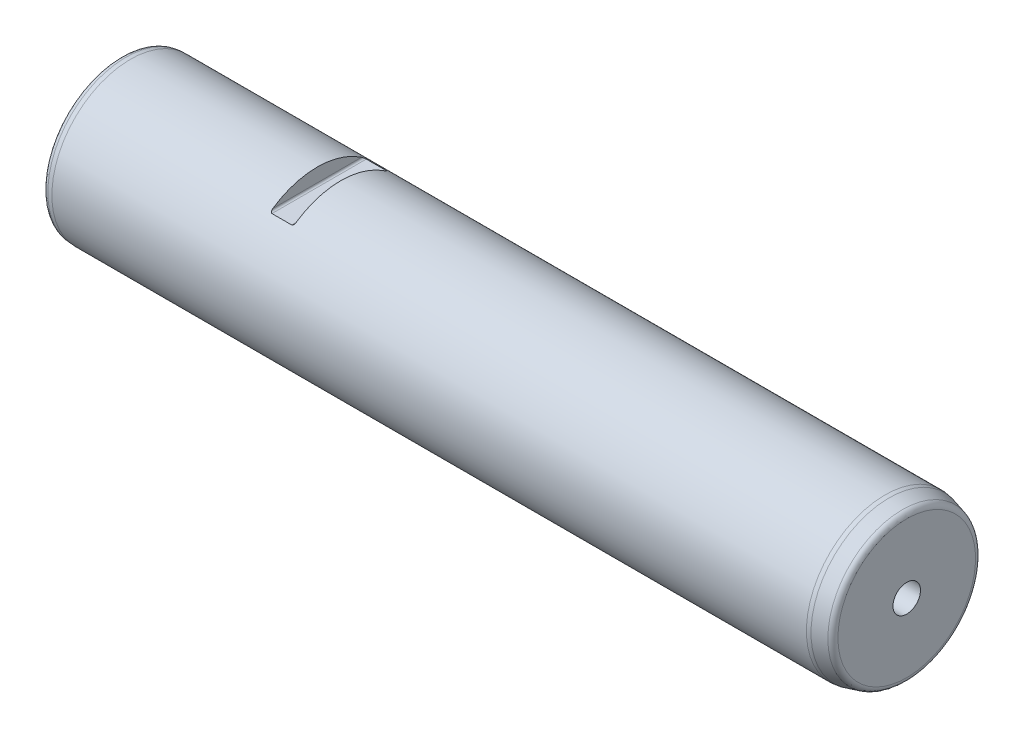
ISO-10303-21;
HEADER;
FILE_DESCRIPTION(('STEP AP214'),'2;1');
FILE_NAME('part.step','',(''),(''),'','','');
FILE_SCHEMA(('AUTOMOTIVE_DESIGN { 1 0 10303 214 1 1 1 1 }'));
ENDSEC;
DATA;
#1=APPLICATION_CONTEXT('core data for automotive mechanical design processes');
#2=APPLICATION_PROTOCOL_DEFINITION('international standard','automotive_design',2000,#1);
#3=PRODUCT_CONTEXT('',#1,'mechanical');
#4=PRODUCT('Part','Part','',(#3));
#5=PRODUCT_RELATED_PRODUCT_CATEGORY('part','',(#4));
#6=PRODUCT_DEFINITION_FORMATION('','',#4);
#7=PRODUCT_DEFINITION_CONTEXT('part definition',#1,'design');
#8=PRODUCT_DEFINITION('design','',#6,#7);
#9=PRODUCT_DEFINITION_SHAPE('','',#8);
#10=(LENGTH_UNIT() NAMED_UNIT(*) SI_UNIT(.MILLI.,.METRE.));
#11=(NAMED_UNIT(*) PLANE_ANGLE_UNIT() SI_UNIT($,.RADIAN.));
#12=(NAMED_UNIT(*) SI_UNIT($,.STERADIAN.) SOLID_ANGLE_UNIT());
#13=UNCERTAINTY_MEASURE_WITH_UNIT(LENGTH_MEASURE(1.E-05),#10,'distance_accuracy_value','');
#14=(GEOMETRIC_REPRESENTATION_CONTEXT(3) GLOBAL_UNCERTAINTY_ASSIGNED_CONTEXT((#13)) GLOBAL_UNIT_ASSIGNED_CONTEXT((#10,
#11,#12)) REPRESENTATION_CONTEXT('',''));
#15=CARTESIAN_POINT('',(0.,0.,0.));
#16=DIRECTION('',(0.,0.,1.));
#17=DIRECTION('',(1.,0.,0.));
#18=AXIS2_PLACEMENT_3D('',#15,#16,#17);
#19=CARTESIAN_POINT('',(0.,0.,0.));
#20=DIRECTION('',(1.,0.,0.));
#21=DIRECTION('',(0.,0.,-1.));
#22=AXIS2_PLACEMENT_3D('',#19,#20,#21);
#23=PLANE('',#22);
#24=CARTESIAN_POINT('',(0.,0.,0.));
#25=DIRECTION('',(1.,0.,0.));
#26=DIRECTION('',(0.,0.,-1.));
#27=AXIS2_PLACEMENT_3D('',#24,#25,#26);
#28=CIRCLE('',#27,36.8135631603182);
#29=CARTESIAN_POINT('',(0.,0.,-36.8135631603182));
#30=VERTEX_POINT('',#29);
#31=EDGE_CURVE('E158',#30,#30,#28,.F.);
#32=ORIENTED_EDGE('',*,*,#31,.T.);
#33=EDGE_LOOP('',(#32));
#34=FACE_BOUND('',#33,.T.);
#35=ADVANCED_FACE('F15',(#34),#23,.F.);
#36=CARTESIAN_POINT('',(0.,0.,0.));
#37=DIRECTION('',(-1.,0.,0.));
#38=DIRECTION('',(0.,0.,1.));
#39=AXIS2_PLACEMENT_3D('',#36,#37,#38);
#40=CYLINDRICAL_SURFACE('',#39,40.);
#41=CARTESIAN_POINT('',(112.,0.,0.));
#42=DIRECTION('',(1.,0.,0.));
#43=DIRECTION('',(0.,1.,0.));
#44=AXIS2_PLACEMENT_3D('',#41,#42,#43);
#45=CIRCLE('',#44,40.);
#46=CARTESIAN_POINT('',(112.,33.,-22.6053091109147));
#47=VERTEX_POINT('',#46);
#48=CARTESIAN_POINT('',(112.,33.,22.6053091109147));
#49=VERTEX_POINT('',#48);
#50=EDGE_CURVE('E9',#47,#49,#45,.T.);
#51=ORIENTED_EDGE('',*,*,#50,.T.);
#52=CARTESIAN_POINT('',(112.,33.,22.6053091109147));
#53=CARTESIAN_POINT('',(111.999956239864,32.9533062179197,22.6734793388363));
#54=CARTESIAN_POINT('',(111.996724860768,32.9063709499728,22.7415390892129));
#55=CARTESIAN_POINT('',(111.9833741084,32.8121892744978,22.8772162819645));
#56=CARTESIAN_POINT('',(111.973223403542,32.764942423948,22.9448302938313));
#57=CARTESIAN_POINT('',(111.945383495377,32.6703030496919,23.0793877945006));
#58=CARTESIAN_POINT('',(111.927624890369,32.6229132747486,23.1463191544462));
#59=CARTESIAN_POINT('',(111.883718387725,32.5291271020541,23.277937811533));
#60=CARTESIAN_POINT('',(111.857588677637,32.4827287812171,23.3426296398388));
#61=CARTESIAN_POINT('',(111.802378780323,32.4016320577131,23.4550198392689));
#62=CARTESIAN_POINT('',(111.77516014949,32.3665742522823,23.5033665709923));
#63=CARTESIAN_POINT('',(111.713954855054,32.2983090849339,23.5970884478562));
#64=CARTESIAN_POINT('',(111.679967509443,32.2651019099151,23.6424632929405));
#65=CARTESIAN_POINT('',(111.603736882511,32.201241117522,23.7293702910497));
#66=CARTESIAN_POINT('',(111.561384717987,32.1706297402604,23.7708397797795));
#67=CARTESIAN_POINT('',(111.467801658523,32.1145012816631,23.8466142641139));
#68=CARTESIAN_POINT('',(111.416609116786,32.0889631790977,23.8809488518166));
#69=CARTESIAN_POINT('',(111.329466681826,32.0552261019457,23.9261971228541));
#70=CARTESIAN_POINT('',(111.29649313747,32.0443038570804,23.9408193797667));
#71=CARTESIAN_POINT('',(111.228097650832,32.0257208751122,23.9656721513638));
#72=CARTESIAN_POINT('',(111.192682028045,32.0180520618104,23.9759135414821));
#73=CARTESIAN_POINT('',(111.130975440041,32.0082798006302,23.9889572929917));
#74=CARTESIAN_POINT('',(111.10511035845,32.0051988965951,23.9930670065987));
#75=CARTESIAN_POINT('',(111.05284071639,32.0010479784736,23.998602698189));
#76=CARTESIAN_POINT('',(111.026434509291,31.9999854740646,24.0000186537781));
#77=CARTESIAN_POINT('',(111.,32.,24.));
#78=B_SPLINE_CURVE_WITH_KNOTS('',3,(#52,#53,#54,#55,#56,#57,#58,#59,#60,#61,#62,#63,#64,#65,#66,
#67,#68,#69,#70,#71,#72,#73,#74,#75,#76,#77),.UNSPECIFIED.,.F.,.F.,(4,2,2,2,2,2,2,2,2,2,2,2,4),
(0.,0.247894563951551,0.496919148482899,0.748265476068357,0.999069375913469,1.19560905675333,
1.39216855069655,1.59147884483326,1.78994522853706,1.90262338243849,2.01502016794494,
2.09392287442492,2.17311857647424),.UNSPECIFIED.);
#79=CARTESIAN_POINT('',(111.,32.,24.));
#80=VERTEX_POINT('',#79);
#81=EDGE_CURVE('E23',#49,#80,#78,.T.);
#82=ORIENTED_EDGE('',*,*,#81,.T.);
#83=DIRECTION('',(-1.,0.,0.));
#84=VECTOR('',#83,1.);
#85=CARTESIAN_POINT('',(0.,32.,24.));
#86=LINE('',#85,#84);
#87=CARTESIAN_POINT('',(101.,32.,24.));
#88=VERTEX_POINT('',#87);
#89=EDGE_CURVE('E72',#80,#88,#86,.T.);
#90=ORIENTED_EDGE('',*,*,#89,.T.);
#91=CARTESIAN_POINT('',(101.,32.,24.));
#92=CARTESIAN_POINT('',(100.979515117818,31.9999961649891,24.0000048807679));
#93=CARTESIAN_POINT('',(100.959045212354,32.0006300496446,23.9991599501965));
#94=CARTESIAN_POINT('',(100.918340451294,32.0031320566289,23.9958234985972));
#95=CARTESIAN_POINT('',(100.898105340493,32.0049986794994,23.9933339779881));
#96=CARTESIAN_POINT('',(100.838485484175,32.0123267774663,23.9835569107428));
#97=CARTESIAN_POINT('',(100.799665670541,32.0195187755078,23.9739578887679));
#98=CARTESIAN_POINT('',(100.724972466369,32.0377946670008,23.949528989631));
#99=CARTESIAN_POINT('',(100.689086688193,32.048861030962,23.9347226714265));
#100=CARTESIAN_POINT('',(100.620448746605,32.0741044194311,23.9008843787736));
#101=CARTESIAN_POINT('',(100.587706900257,32.0882912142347,23.8818391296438));
#102=CARTESIAN_POINT('',(100.50892843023,32.1272536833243,23.8294171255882));
#103=CARTESIAN_POINT('',(100.46516671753,32.1536303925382,23.7938287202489));
#104=CARTESIAN_POINT('',(100.38502670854,32.209926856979,23.7175646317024));
#105=CARTESIAN_POINT('',(100.34866354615,32.2398536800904,23.6768787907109));
#106=CARTESIAN_POINT('',(100.288885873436,32.2959720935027,23.6002540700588));
#107=CARTESIAN_POINT('',(100.264326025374,32.3217752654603,23.5649069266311));
#108=CARTESIAN_POINT('',(100.219071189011,32.3744164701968,23.4925343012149));
#109=CARTESIAN_POINT('',(100.198378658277,32.4012551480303,23.4555077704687));
#110=CARTESIAN_POINT('',(100.141431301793,32.4829971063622,23.3423121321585));
#111=CARTESIAN_POINT('',(100.110455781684,32.5389782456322,23.2642288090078));
#112=CARTESIAN_POINT('',(100.07059809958,32.6291137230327,23.1375093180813));
#113=CARTESIAN_POINT('',(100.057848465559,32.662928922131,23.0897499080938));
#114=CARTESIAN_POINT('',(100.036262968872,32.7307800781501,22.9934663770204));
#115=CARTESIAN_POINT('',(100.027428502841,32.7648161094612,22.9449419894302));
#116=CARTESIAN_POINT('',(100.013537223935,32.832462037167,22.8480389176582));
#117=CARTESIAN_POINT('',(100.008432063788,32.8660716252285,22.7996667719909));
#118=CARTESIAN_POINT('',(100.001670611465,32.9331582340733,22.7026556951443));
#119=CARTESIAN_POINT('',(100.000011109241,32.9666353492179,22.6540170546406));
#120=CARTESIAN_POINT('',(100.,33.,22.6053091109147));
#121=B_SPLINE_CURVE_WITH_KNOTS('',3,(#91,#92,#93,#94,#95,#96,#97,#98,#99,#100,#101,#102,#103,
#104,#105,#106,#107,#108,#109,#110,#111,#112,#113,#114,#115,#116,#117,#118,#119,#120),
.UNSPECIFIED.,.F.,.F.,(4,2,2,2,2,2,2,2,2,2,2,2,2,2,4),(0.,0.0613996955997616,0.12272484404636,
0.243841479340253,0.364417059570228,0.485375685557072,0.671136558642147,0.857273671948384,
1.00761587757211,1.15805329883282,1.45979260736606,1.63937001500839,1.81901143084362,
1.9962804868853,2.17338432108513),.UNSPECIFIED.);
#122=CARTESIAN_POINT('',(100.,33.,22.6053091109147));
#123=VERTEX_POINT('',#122);
#124=EDGE_CURVE('E64',#88,#123,#121,.T.);
#125=ORIENTED_EDGE('',*,*,#124,.T.);
#126=CARTESIAN_POINT('',(100.,0.,0.));
#127=DIRECTION('',(-1.,0.,0.));
#128=DIRECTION('',(0.,-1.,0.));
#129=AXIS2_PLACEMENT_3D('',#126,#127,#128);
#130=CIRCLE('',#129,40.);
#131=CARTESIAN_POINT('',(100.,33.,-22.6053091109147));
#132=VERTEX_POINT('',#131);
#133=EDGE_CURVE('E53',#123,#132,#130,.T.);
#134=ORIENTED_EDGE('',*,*,#133,.T.);
#135=CARTESIAN_POINT('',(100.,33.,-22.6053091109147));
#136=CARTESIAN_POINT('',(100.000043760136,32.9533062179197,-22.6734793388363));
#137=CARTESIAN_POINT('',(100.003275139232,32.9063709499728,-22.7415390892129));
#138=CARTESIAN_POINT('',(100.0166258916,32.8121892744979,-22.8772162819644));
#139=CARTESIAN_POINT('',(100.026776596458,32.764942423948,-22.9448302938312));
#140=CARTESIAN_POINT('',(100.054616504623,32.670303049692,-23.0793877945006));
#141=CARTESIAN_POINT('',(100.072375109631,32.6229132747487,-23.1463191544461));
#142=CARTESIAN_POINT('',(100.116281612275,32.5291271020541,-23.277937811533));
#143=CARTESIAN_POINT('',(100.142411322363,32.4827287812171,-23.3426296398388));
#144=CARTESIAN_POINT('',(100.197621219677,32.4016320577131,-23.4550198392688));
#145=CARTESIAN_POINT('',(100.22483985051,32.3665742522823,-23.5033665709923));
#146=CARTESIAN_POINT('',(100.286045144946,32.2983090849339,-23.5970884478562));
#147=CARTESIAN_POINT('',(100.320032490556,32.2651019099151,-23.6424632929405));
#148=CARTESIAN_POINT('',(100.396263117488,32.201241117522,-23.7293702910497));
#149=CARTESIAN_POINT('',(100.438615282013,32.1706297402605,-23.7708397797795));
#150=CARTESIAN_POINT('',(100.532198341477,32.1145012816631,-23.8466142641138));
#151=CARTESIAN_POINT('',(100.583390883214,32.0889631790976,-23.8809488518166));
#152=CARTESIAN_POINT('',(100.670533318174,32.0552261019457,-23.9261971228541));
#153=CARTESIAN_POINT('',(100.70350686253,32.0443038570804,-23.9408193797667));
#154=CARTESIAN_POINT('',(100.771902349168,32.0257208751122,-23.9656721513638));
#155=CARTESIAN_POINT('',(100.807317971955,32.0180520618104,-23.9759135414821));
#156=CARTESIAN_POINT('',(100.869024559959,32.0082798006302,-23.9889572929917));
#157=CARTESIAN_POINT('',(100.89488964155,32.0051988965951,-23.9930670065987));
#158=CARTESIAN_POINT('',(100.94715928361,32.0010479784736,-23.998602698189));
#159=CARTESIAN_POINT('',(100.973565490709,31.9999854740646,-24.0000186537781));
#160=CARTESIAN_POINT('',(101.,32.,-24.));
#161=B_SPLINE_CURVE_WITH_KNOTS('',3,(#135,#136,#137,#138,#139,#140,#141,#142,#143,#144,#145,
#146,#147,#148,#149,#150,#151,#152,#153,#154,#155,#156,#157,#158,#159,#160),.UNSPECIFIED.,.F.,
.F.,(4,2,2,2,2,2,2,2,2,2,2,2,4),(0.,0.247894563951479,0.496919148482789,0.748265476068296,
0.999069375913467,1.19560905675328,1.39216855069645,1.59147884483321,1.7899452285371,
1.90262338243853,2.01502016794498,2.09392287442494,2.17311857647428),.UNSPECIFIED.);
#162=CARTESIAN_POINT('',(101.,32.,-24.));
#163=VERTEX_POINT('',#162);
#164=EDGE_CURVE('E58',#132,#163,#161,.T.);
#165=ORIENTED_EDGE('',*,*,#164,.T.);
#166=DIRECTION('',(-1.,0.,0.));
#167=VECTOR('',#166,1.);
#168=CARTESIAN_POINT('',(0.,32.,-24.));
#169=LINE('',#168,#167);
#170=CARTESIAN_POINT('',(111.,32.,-24.));
#171=VERTEX_POINT('',#170);
#172=EDGE_CURVE('E73',#163,#171,#169,.F.);
#173=ORIENTED_EDGE('',*,*,#172,.T.);
#174=CARTESIAN_POINT('',(111.,32.,-24.));
#175=CARTESIAN_POINT('',(111.020484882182,31.9999961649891,-24.0000048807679));
#176=CARTESIAN_POINT('',(111.040954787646,32.0006300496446,-23.9991599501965));
#177=CARTESIAN_POINT('',(111.081659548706,32.0031320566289,-23.9958234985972));
#178=CARTESIAN_POINT('',(111.101894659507,32.0049986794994,-23.9933339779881));
#179=CARTESIAN_POINT('',(111.161514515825,32.0123267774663,-23.9835569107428));
#180=CARTESIAN_POINT('',(111.200334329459,32.0195187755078,-23.9739578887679));
#181=CARTESIAN_POINT('',(111.275027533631,32.0377946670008,-23.949528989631));
#182=CARTESIAN_POINT('',(111.310913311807,32.048861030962,-23.9347226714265));
#183=CARTESIAN_POINT('',(111.379551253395,32.0741044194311,-23.9008843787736));
#184=CARTESIAN_POINT('',(111.412293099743,32.0882912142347,-23.8818391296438));
#185=CARTESIAN_POINT('',(111.49107156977,32.1272536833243,-23.8294171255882));
#186=CARTESIAN_POINT('',(111.53483328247,32.1536303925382,-23.7938287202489));
#187=CARTESIAN_POINT('',(111.61497329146,32.209926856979,-23.7175646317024));
#188=CARTESIAN_POINT('',(111.65133645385,32.2398536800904,-23.6768787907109));
#189=CARTESIAN_POINT('',(111.711114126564,32.2959720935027,-23.6002540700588));
#190=CARTESIAN_POINT('',(111.735673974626,32.3217752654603,-23.5649069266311));
#191=CARTESIAN_POINT('',(111.780928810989,32.3744164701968,-23.492534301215));
#192=CARTESIAN_POINT('',(111.801621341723,32.4012551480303,-23.4555077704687));
#193=CARTESIAN_POINT('',(111.858568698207,32.4829971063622,-23.3423121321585));
#194=CARTESIAN_POINT('',(111.889544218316,32.5389782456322,-23.2642288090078));
#195=CARTESIAN_POINT('',(111.92940190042,32.6291137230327,-23.1375093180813));
#196=CARTESIAN_POINT('',(111.942151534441,32.662928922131,-23.0897499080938));
#197=CARTESIAN_POINT('',(111.963737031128,32.7307800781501,-22.9934663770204));
#198=CARTESIAN_POINT('',(111.972571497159,32.7648161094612,-22.9449419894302));
#199=CARTESIAN_POINT('',(111.986462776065,32.832462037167,-22.8480389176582));
#200=CARTESIAN_POINT('',(111.991567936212,32.8660716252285,-22.7996667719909));
#201=CARTESIAN_POINT('',(111.998329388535,32.9331582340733,-22.7026556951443));
#202=CARTESIAN_POINT('',(111.999988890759,32.9666353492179,-22.6540170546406));
#203=CARTESIAN_POINT('',(112.,33.,-22.6053091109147));
#204=B_SPLINE_CURVE_WITH_KNOTS('',3,(#174,#175,#176,#177,#178,#179,#180,#181,#182,#183,#184,
#185,#186,#187,#188,#189,#190,#191,#192,#193,#194,#195,#196,#197,#198,#199,#200,#201,#202,#203),
.UNSPECIFIED.,.F.,.F.,(4,2,2,2,2,2,2,2,2,2,2,2,2,2,4),(0.,0.0613996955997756,0.122724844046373,
0.243841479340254,0.364417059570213,0.485375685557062,0.671136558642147,0.857273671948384,
1.00761587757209,1.15805329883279,1.45979260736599,1.63937001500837,1.81901143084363,
1.99628048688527,2.17338432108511),.UNSPECIFIED.);
#205=EDGE_CURVE('E207',#171,#47,#204,.T.);
#206=ORIENTED_EDGE('',*,*,#205,.T.);
#207=EDGE_LOOP('',(#51,#82,#90,#125,#134,#165,#173,#206));
#208=FACE_BOUND('',#207,.T.);
#209=CARTESIAN_POINT('',(4.99999999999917,0.,0.));
#210=DIRECTION('',(1.,0.,0.));
#211=DIRECTION('',(0.,0.,-1.));
#212=AXIS2_PLACEMENT_3D('',#209,#210,#211);
#213=CIRCLE('',#212,40.);
#214=CARTESIAN_POINT('',(4.99999999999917,0.,-40.));
#215=VERTEX_POINT('',#214);
#216=EDGE_CURVE('E157',#215,#215,#213,.T.);
#217=ORIENTED_EDGE('',*,*,#216,.T.);
#218=EDGE_LOOP('',(#217));
#219=FACE_BOUND('',#218,.T.);
#220=CARTESIAN_POINT('',(388.946780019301,0.,0.));
#221=DIRECTION('',(1.,0.,0.));
#222=DIRECTION('',(0.,0.,-1.));
#223=AXIS2_PLACEMENT_3D('',#220,#221,#222);
#224=CIRCLE('',#223,40.);
#225=CARTESIAN_POINT('',(388.946780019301,0.,-40.));
#226=VERTEX_POINT('',#225);
#227=EDGE_CURVE('E175',#226,#226,#224,.F.);
#228=ORIENTED_EDGE('',*,*,#227,.T.);
#229=EDGE_LOOP('',(#228));
#230=FACE_BOUND('',#229,.T.);
#231=ADVANCED_FACE('F69',(#208,#219,#230),#40,.T.);
#232=CARTESIAN_POINT('',(400.,0.,0.));
#233=DIRECTION('',(-1.,0.,0.));
#234=DIRECTION('',(0.,0.,1.));
#235=AXIS2_PLACEMENT_3D('',#232,#233,#234);
#236=CONICAL_SURFACE('',#235,37.3205080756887,0.26179938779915);
#237=CARTESIAN_POINT('',(397.776457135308,0.,0.));
#238=DIRECTION('',(1.,0.,0.));
#239=DIRECTION('',(0.,0.,-1.));
#240=AXIS2_PLACEMENT_3D('',#237,#238,#239);
#241=CIRCLE('',#240,37.9163045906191);
#242=CARTESIAN_POINT('',(397.776457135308,0.,-37.9163045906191));
#243=VERTEX_POINT('',#242);
#244=EDGE_CURVE('E163',#243,#243,#241,.F.);
#245=ORIENTED_EDGE('',*,*,#244,.T.);
#246=EDGE_LOOP('',(#245));
#247=FACE_BOUND('',#246,.T.);
#248=CARTESIAN_POINT('',(391.017332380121,0.,0.));
#249=DIRECTION('',(1.,0.,0.));
#250=DIRECTION('',(0.,0.,-1.));
#251=AXIS2_PLACEMENT_3D('',#248,#249,#250);
#252=CIRCLE('',#251,39.7274066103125);
#253=CARTESIAN_POINT('',(391.017332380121,0.,-39.7274066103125));
#254=VERTEX_POINT('',#253);
#255=EDGE_CURVE('E188',#254,#254,#252,.T.);
#256=ORIENTED_EDGE('',*,*,#255,.T.);
#257=EDGE_LOOP('',(#256));
#258=FACE_BOUND('',#257,.T.);
#259=ADVANCED_FACE('F120',(#247,#258),#236,.T.);
#260=CARTESIAN_POINT('',(400.,37.3205080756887,0.));
#261=DIRECTION('',(-1.,0.,0.));
#262=DIRECTION('',(0.,0.,1.));
#263=AXIS2_PLACEMENT_3D('',#260,#261,#262);
#264=PLANE('',#263);
#265=CARTESIAN_POINT('',(400.,0.,0.));
#266=DIRECTION('',(1.,0.,0.));
#267=DIRECTION('',(0.,0.,-1.));
#268=AXIS2_PLACEMENT_3D('',#265,#266,#267);
#269=CIRCLE('',#268,7.);
#270=CARTESIAN_POINT('',(400.,0.,-7.));
#271=VERTEX_POINT('',#270);
#272=EDGE_CURVE('E178',#271,#271,#269,.T.);
#273=ORIENTED_EDGE('',*,*,#272,.F.);
#274=EDGE_LOOP('',(#273));
#275=FACE_BOUND('',#274,.T.);
#276=CARTESIAN_POINT('',(400.,0.,0.));
#277=DIRECTION('',(-1.,0.,0.));
#278=DIRECTION('',(0.,0.,1.));
#279=AXIS2_PLACEMENT_3D('',#276,#277,#278);
#280=CIRCLE('',#279,35.0185271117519);
#281=CARTESIAN_POINT('',(400.,0.,35.0185271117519));
#282=VERTEX_POINT('',#281);
#283=EDGE_CURVE('E159',#282,#282,#280,.F.);
#284=ORIENTED_EDGE('',*,*,#283,.T.);
#285=EDGE_LOOP('',(#284));
#286=FACE_BOUND('',#285,.T.);
#287=ADVANCED_FACE('F117',(#275,#286),#264,.F.);
#288=CARTESIAN_POINT('',(388.946780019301,0.,0.));
#289=DIRECTION('',(1.,0.,0.));
#290=DIRECTION('',(0.,0.,-1.));
#291=AXIS2_PLACEMENT_3D('',#288,#289,#290);
#292=TOROIDAL_SURFACE('',#291,32.,8.);
#293=ORIENTED_EDGE('',*,*,#255,.F.);
#294=EDGE_LOOP('',(#293));
#295=FACE_BOUND('',#294,.T.);
#296=ORIENTED_EDGE('',*,*,#227,.F.);
#297=EDGE_LOOP('',(#296));
#298=FACE_BOUND('',#297,.T.);
#299=ADVANCED_FACE('F119',(#295,#298),#292,.T.);
#300=CARTESIAN_POINT('',(397.,0.,0.));
#301=DIRECTION('',(-1.,0.,0.));
#302=DIRECTION('',(0.,0.,1.));
#303=AXIS2_PLACEMENT_3D('',#300,#301,#302);
#304=TOROIDAL_SURFACE('',#303,35.0185271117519,3.);
#305=ORIENTED_EDGE('',*,*,#283,.F.);
#306=EDGE_LOOP('',(#305));
#307=FACE_BOUND('',#306,.T.);
#308=ORIENTED_EDGE('',*,*,#244,.F.);
#309=EDGE_LOOP('',(#308));
#310=FACE_BOUND('',#309,.T.);
#311=ADVANCED_FACE('F140',(#307,#310),#304,.T.);
#312=CARTESIAN_POINT('',(0.,0.,0.));
#313=DIRECTION('',(1.,0.,0.));
#314=DIRECTION('',(0.,0.,-1.));
#315=AXIS2_PLACEMENT_3D('',#312,#313,#314);
#316=CONICAL_SURFACE('',#315,39.5625566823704,0.0872664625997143);
#317=CARTESIAN_POINT('',(2.73853277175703,0.,0.));
#318=DIRECTION('',(1.,0.,0.));
#319=DIRECTION('',(0.,0.,-1.));
#320=AXIS2_PLACEMENT_3D('',#317,#318,#319);
#321=CIRCLE('',#320,39.8021472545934);
#322=CARTESIAN_POINT('',(2.73853277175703,0.,-39.8021472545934));
#323=VERTEX_POINT('',#322);
#324=EDGE_CURVE('E59',#323,#323,#321,.T.);
#325=ORIENTED_EDGE('',*,*,#324,.T.);
#326=EDGE_LOOP('',(#325));
#327=FACE_BOUND('',#326,.T.);
#328=ORIENTED_EDGE('',*,*,#216,.F.);
#329=EDGE_LOOP('',(#328));
#330=FACE_BOUND('',#329,.T.);
#331=ADVANCED_FACE('F143',(#327,#330),#316,.T.);
#332=CARTESIAN_POINT('',(3.,0.,0.));
#333=DIRECTION('',(1.,0.,0.));
#334=DIRECTION('',(0.,0.,-1.));
#335=AXIS2_PLACEMENT_3D('',#332,#333,#334);
#336=TOROIDAL_SURFACE('',#335,36.8135631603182,3.);
#337=ORIENTED_EDGE('',*,*,#324,.F.);
#338=EDGE_LOOP('',(#337));
#339=FACE_BOUND('',#338,.T.);
#340=ORIENTED_EDGE('',*,*,#31,.F.);
#341=EDGE_LOOP('',(#340));
#342=FACE_BOUND('',#341,.T.);
#343=ADVANCED_FACE('F17',(#339,#342),#336,.T.);
#344=CARTESIAN_POINT('',(376.,0.,0.));
#345=DIRECTION('',(1.,0.,0.));
#346=DIRECTION('',(0.,0.,-1.));
#347=AXIS2_PLACEMENT_3D('',#344,#345,#346);
#348=PLANE('',#347);
#349=CARTESIAN_POINT('',(376.,0.,0.));
#350=DIRECTION('',(1.,0.,0.));
#351=DIRECTION('',(0.,0.,-1.));
#352=AXIS2_PLACEMENT_3D('',#349,#350,#351);
#353=CIRCLE('',#352,7.);
#354=CARTESIAN_POINT('',(376.,0.,-7.));
#355=VERTEX_POINT('',#354);
#356=EDGE_CURVE('E171',#355,#355,#353,.T.);
#357=ORIENTED_EDGE('',*,*,#356,.T.);
#358=EDGE_LOOP('',(#357));
#359=FACE_BOUND('',#358,.T.);
#360=CARTESIAN_POINT('',(376.,0.,0.));
#361=DIRECTION('',(1.,0.,0.));
#362=DIRECTION('',(0.,0.,-1.));
#363=AXIS2_PLACEMENT_3D('',#360,#361,#362);
#364=CIRCLE('',#363,5.1);
#365=CARTESIAN_POINT('',(376.,0.,-5.1));
#366=VERTEX_POINT('',#365);
#367=EDGE_CURVE('E168',#366,#366,#364,.F.);
#368=ORIENTED_EDGE('',*,*,#367,.T.);
#369=EDGE_LOOP('',(#368));
#370=FACE_BOUND('',#369,.T.);
#371=ADVANCED_FACE('F101',(#359,#370),#348,.T.);
#372=CARTESIAN_POINT('',(376.,0.,0.));
#373=DIRECTION('',(1.,0.,0.));
#374=DIRECTION('',(0.,0.,-1.));
#375=AXIS2_PLACEMENT_3D('',#372,#373,#374);
#376=CYLINDRICAL_SURFACE('',#375,7.);
#377=ORIENTED_EDGE('',*,*,#356,.F.);
#378=EDGE_LOOP('',(#377));
#379=FACE_BOUND('',#378,.T.);
#380=ORIENTED_EDGE('',*,*,#272,.T.);
#381=EDGE_LOOP('',(#380));
#382=FACE_BOUND('',#381,.T.);
#383=ADVANCED_FACE('F104',(#379,#382),#376,.F.);
#384=CARTESIAN_POINT('',(370.,0.,0.));
#385=DIRECTION('',(1.,0.,0.));
#386=DIRECTION('',(0.,0.,-1.));
#387=AXIS2_PLACEMENT_3D('',#384,#385,#386);
#388=CONICAL_SURFACE('',#387,5.1,1.0471975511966);
#389=CARTESIAN_POINT('',(367.055513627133,0.,0.));
#390=VERTEX_POINT('',#389);
#391=VERTEX_LOOP('',#390);
#392=FACE_BOUND('',#391,.T.);
#393=CARTESIAN_POINT('',(370.,0.,0.));
#394=DIRECTION('',(1.,0.,0.));
#395=DIRECTION('',(0.,0.,-1.));
#396=AXIS2_PLACEMENT_3D('',#393,#394,#395);
#397=CIRCLE('',#396,5.1);
#398=CARTESIAN_POINT('',(370.,0.,-5.1));
#399=VERTEX_POINT('',#398);
#400=EDGE_CURVE('E170',#399,#399,#397,.T.);
#401=ORIENTED_EDGE('',*,*,#400,.T.);
#402=EDGE_LOOP('',(#401));
#403=FACE_BOUND('',#402,.T.);
#404=ADVANCED_FACE('F108',(#392,#403),#388,.F.);
#405=CARTESIAN_POINT('',(400.,0.,0.));
#406=DIRECTION('',(1.,0.,0.));
#407=DIRECTION('',(0.,0.,-1.));
#408=AXIS2_PLACEMENT_3D('',#405,#406,#407);
#409=CYLINDRICAL_SURFACE('',#408,5.1);
#410=ORIENTED_EDGE('',*,*,#400,.F.);
#411=EDGE_LOOP('',(#410));
#412=FACE_BOUND('',#411,.T.);
#413=ORIENTED_EDGE('',*,*,#367,.F.);
#414=EDGE_LOOP('',(#413));
#415=FACE_BOUND('',#414,.T.);
#416=ADVANCED_FACE('F110',(#412,#415),#409,.F.);
#417=CARTESIAN_POINT('',(112.,33.,-40.));
#418=DIRECTION('',(1.,0.,0.));
#419=DIRECTION('',(0.,1.,0.));
#420=AXIS2_PLACEMENT_3D('',#417,#418,#419);
#421=PLANE('',#420);
#422=ORIENTED_EDGE('',*,*,#50,.F.);
#423=DIRECTION('',(0.,0.,1.));
#424=VECTOR('',#423,1.);
#425=CARTESIAN_POINT('',(112.,33.,-40.));
#426=LINE('',#425,#424);
#427=EDGE_CURVE('E182',#47,#49,#426,.T.);
#428=ORIENTED_EDGE('',*,*,#427,.T.);
#429=EDGE_LOOP('',(#422,#428));
#430=FACE_BOUND('',#429,.T.);
#431=ADVANCED_FACE('F113',(#430),#421,.F.);
#432=CARTESIAN_POINT('',(111.,33.,-40.));
#433=DIRECTION('',(0.,0.,1.));
#434=DIRECTION('',(1.,0.,0.));
#435=AXIS2_PLACEMENT_3D('',#432,#433,#434);
#436=CYLINDRICAL_SURFACE('',#435,1.);
#437=ORIENTED_EDGE('',*,*,#427,.F.);
#438=ORIENTED_EDGE('',*,*,#205,.F.);
#439=DIRECTION('',(0.,0.,1.));
#440=VECTOR('',#439,1.);
#441=CARTESIAN_POINT('',(111.,32.,-40.));
#442=LINE('',#441,#440);
#443=EDGE_CURVE('E197',#171,#80,#442,.T.);
#444=ORIENTED_EDGE('',*,*,#443,.T.);
#445=ORIENTED_EDGE('',*,*,#81,.F.);
#446=EDGE_LOOP('',(#437,#438,#444,#445));
#447=FACE_BOUND('',#446,.T.);
#448=ADVANCED_FACE('F206',(#447),#436,.F.);
#449=CARTESIAN_POINT('',(101.,32.,-40.));
#450=DIRECTION('',(0.,-1.,0.));
#451=DIRECTION('',(1.,0.,0.));
#452=AXIS2_PLACEMENT_3D('',#449,#450,#451);
#453=PLANE('',#452);
#454=ORIENTED_EDGE('',*,*,#443,.F.);
#455=ORIENTED_EDGE('',*,*,#172,.F.);
#456=DIRECTION('',(0.,0.,1.));
#457=VECTOR('',#456,1.);
#458=CARTESIAN_POINT('',(101.,32.,-40.));
#459=LINE('',#458,#457);
#460=EDGE_CURVE('E66',#163,#88,#459,.T.);
#461=ORIENTED_EDGE('',*,*,#460,.T.);
#462=ORIENTED_EDGE('',*,*,#89,.F.);
#463=EDGE_LOOP('',(#454,#455,#461,#462));
#464=FACE_BOUND('',#463,.T.);
#465=ADVANCED_FACE('F96',(#464),#453,.F.);
#466=CARTESIAN_POINT('',(101.,33.,-40.));
#467=DIRECTION('',(0.,0.,1.));
#468=DIRECTION('',(1.,0.,0.));
#469=AXIS2_PLACEMENT_3D('',#466,#467,#468);
#470=CYLINDRICAL_SURFACE('',#469,1.);
#471=ORIENTED_EDGE('',*,*,#460,.F.);
#472=ORIENTED_EDGE('',*,*,#164,.F.);
#473=DIRECTION('',(0.,0.,1.));
#474=VECTOR('',#473,1.);
#475=CARTESIAN_POINT('',(100.,33.,-40.));
#476=LINE('',#475,#474);
#477=EDGE_CURVE('E29',#132,#123,#476,.T.);
#478=ORIENTED_EDGE('',*,*,#477,.T.);
#479=ORIENTED_EDGE('',*,*,#124,.F.);
#480=EDGE_LOOP('',(#471,#472,#478,#479));
#481=FACE_BOUND('',#480,.T.);
#482=ADVANCED_FACE('F63',(#481),#470,.F.);
#483=CARTESIAN_POINT('',(100.,40.,-40.));
#484=DIRECTION('',(-1.,0.,0.));
#485=DIRECTION('',(0.,-1.,0.));
#486=AXIS2_PLACEMENT_3D('',#483,#484,#485);
#487=PLANE('',#486);
#488=ORIENTED_EDGE('',*,*,#477,.F.);
#489=ORIENTED_EDGE('',*,*,#133,.F.);
#490=EDGE_LOOP('',(#488,#489));
#491=FACE_BOUND('',#490,.T.);
#492=ADVANCED_FACE('F54',(#491),#487,.F.);
#493=CLOSED_SHELL('',(#35,#231,#259,#287,#299,#311,#331,#343,#371,#383,#404,#416,#431,#448,#465,
#482,#492));
#494=MANIFOLD_SOLID_BREP('B1',#493);
#495=ADVANCED_BREP_SHAPE_REPRESENTATION('',(#18,#494),#14);
#496=SHAPE_DEFINITION_REPRESENTATION(#9,#495);
ENDSEC;
END-ISO-10303-21;
